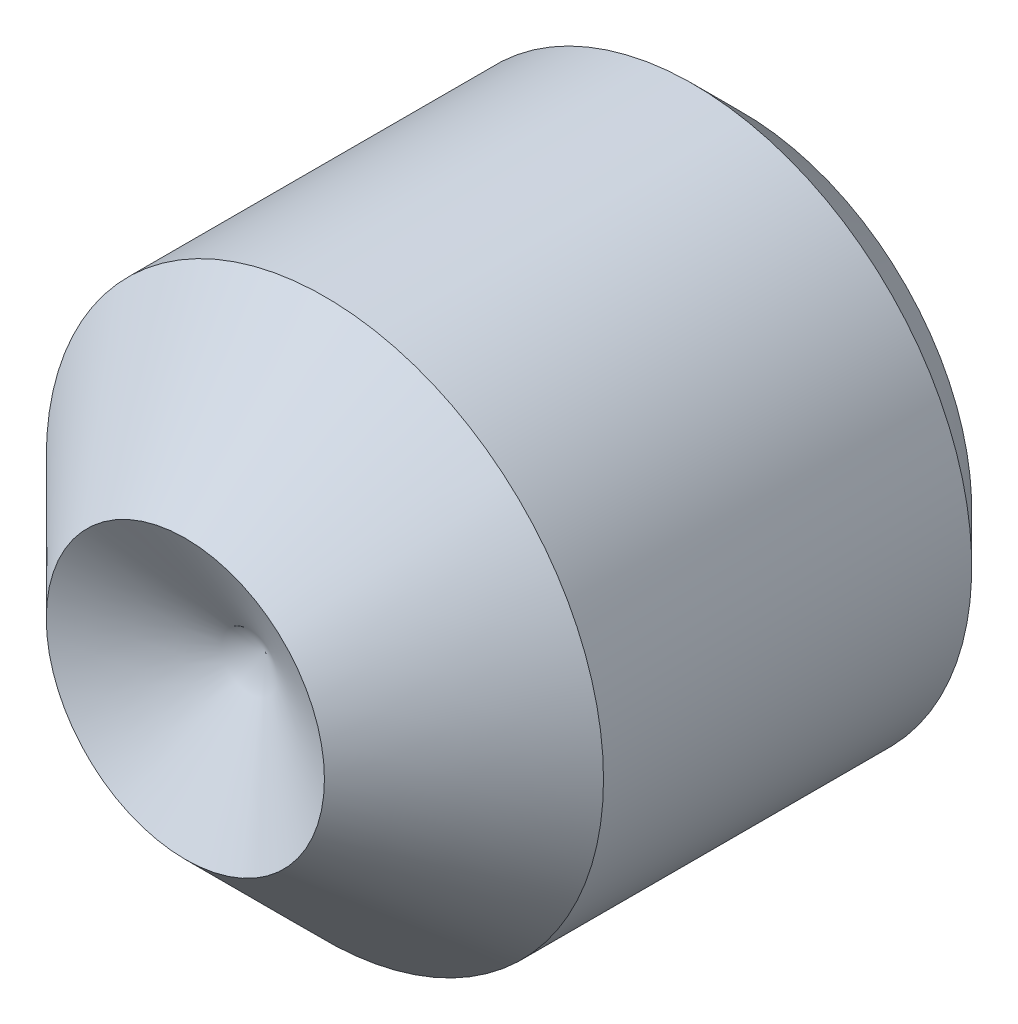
from build123d import *

# Parameters (mm, degrees)
CUT_EXTRUDE1_DEPTH = 2.5


with BuildPart() as part:
    # Logo3_bib1 → Revolve1 (revolve)
    with BuildSketch(Plane(origin=(0, 0, 0), x_dir=(-1, 0, 0), z_dir=(0, -1, 0))):
        Polygon((0, -7.9375), (0, 0), (3.2639, 0), (3.96875, -0.70485), (3.96875, -7.23265), (3.2639, -7.9375), align=None)
    revolve(axis=Axis((0, 0, -10.585154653), (0, 0, 1)))

    # Logo3_bib11 → Cut-Extrude1 (cut)
    with BuildSketch(Plane(origin=(0, 0, 0), x_dir=(1, 0, 0), z_dir=(0, 0, -1))):
        Polygon((2.290625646, 0), (1.145312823, 1.98374), (-1.145312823, 1.98374), (-2.290625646, 0), (-1.145312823, -1.98374), (1.145312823, -1.98374), align=None)
    extrude(amount=-CUT_EXTRUDE1_DEPTH, mode=Mode.SUBTRACT)

    # Logo3_bib3 → Type3 (revolve, cut)
    with BuildSketch(Plane(origin=(0, 0, 0), x_dir=(1, 0, 0), z_dir=(0, 1, 0)), mode=Mode.PRIVATE) as type3_sk:
        Polygon((-1.9812, -7.9375), (-3.96875, -5.94995), (-4.96875, -5.94995), (-4.96875, -8.9375), (0, -8.9375), (0, -6.793653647), align=None)
    revolve(type3_sk.sketch.rotate(Axis((0, 0, 43.517168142), (0, 0, -1)), 180), axis=Axis((0, 0, 43.517168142), (0, 0, -1)), mode=Mode.SUBTRACT)


solid = part.part
